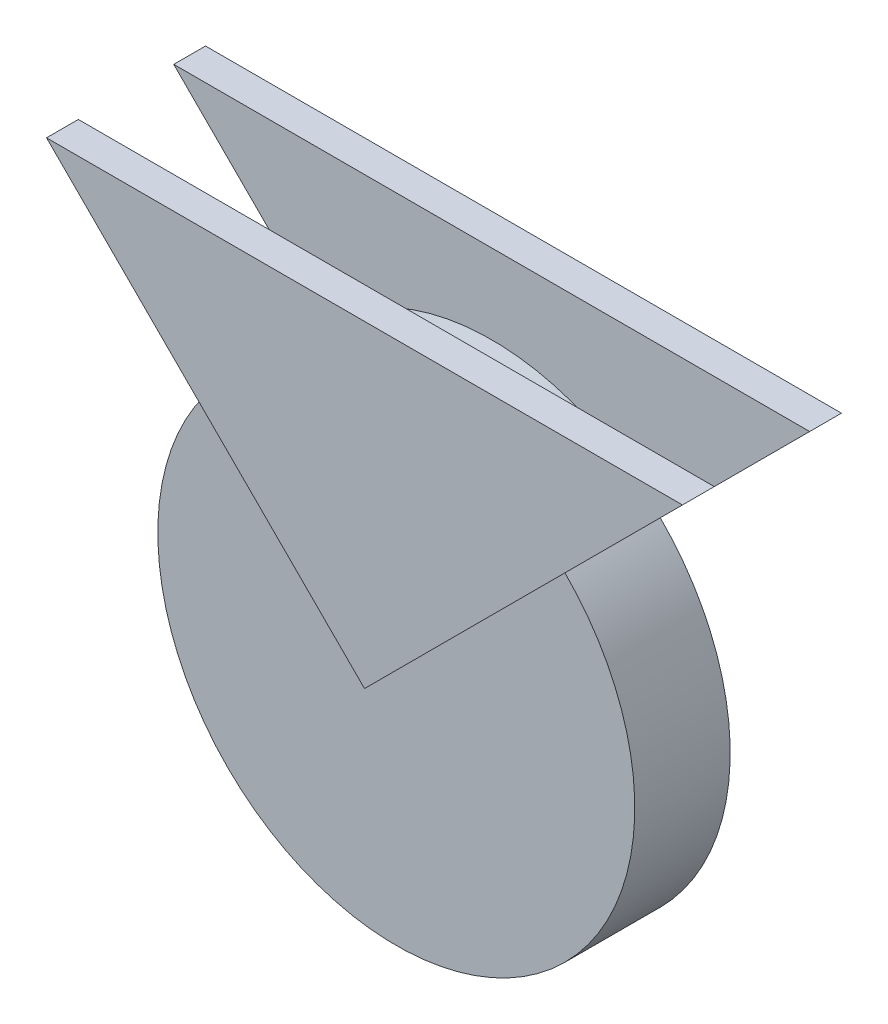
from build123d import *

# Parameters (mm, degrees)
SKETCH1_R           = 75
BOSS_EXTRUDE1_DEPTH = 30
BOSS_EXTRUDE2_DEPTH = 10


with BuildPart() as part:
    # Sketch1 → Boss-Extrude1 (new body)
    with BuildSketch(Plane.XY):
        Circle(SKETCH1_R)
    extrude(amount=BOSS_EXTRUDE1_DEPTH)

    # Sketch2 → Boss-Extrude2 (add)
    with BuildSketch(Plane.XY.offset(30)):
        Polygon((0, 0), (-100, 100), (100, 100), align=None)
    boss_extrude2 = extrude(amount=BOSS_EXTRUDE2_DEPTH)

    # Mirror1: Boss-Extrude2 across plane
    add(boss_extrude2.mirror(Plane(origin=(0, 0, 15), x_dir=(1, 0, 0), z_dir=(0, 0, -1))))


solid = part.part
